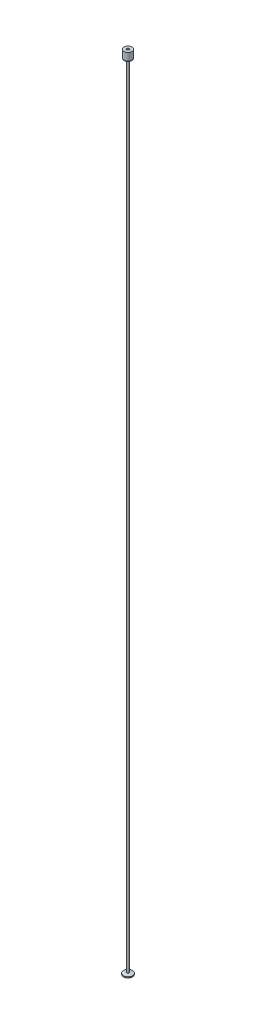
ISO-10303-21;
HEADER;
FILE_DESCRIPTION(('STEP AP214'),'2;1');
FILE_NAME('part.step','',(''),(''),'','','');
FILE_SCHEMA(('AUTOMOTIVE_DESIGN { 1 0 10303 214 1 1 1 1 }'));
ENDSEC;
DATA;
#1=APPLICATION_CONTEXT('core data for automotive mechanical design processes');
#2=APPLICATION_PROTOCOL_DEFINITION('international standard','automotive_design',2000,#1);
#3=PRODUCT_CONTEXT('',#1,'mechanical');
#4=PRODUCT('Part','Part','',(#3));
#5=PRODUCT_RELATED_PRODUCT_CATEGORY('part','',(#4));
#6=PRODUCT_DEFINITION_FORMATION('','',#4);
#7=PRODUCT_DEFINITION_CONTEXT('part definition',#1,'design');
#8=PRODUCT_DEFINITION('design','',#6,#7);
#9=PRODUCT_DEFINITION_SHAPE('','',#8);
#10=(LENGTH_UNIT() NAMED_UNIT(*) SI_UNIT(.MILLI.,.METRE.));
#11=(NAMED_UNIT(*) PLANE_ANGLE_UNIT() SI_UNIT($,.RADIAN.));
#12=(NAMED_UNIT(*) SI_UNIT($,.STERADIAN.) SOLID_ANGLE_UNIT());
#13=UNCERTAINTY_MEASURE_WITH_UNIT(LENGTH_MEASURE(1.E-05),#10,'distance_accuracy_value','');
#14=(GEOMETRIC_REPRESENTATION_CONTEXT(3) GLOBAL_UNCERTAINTY_ASSIGNED_CONTEXT((#13)) GLOBAL_UNIT_ASSIGNED_CONTEXT((#10,
#11,#12)) REPRESENTATION_CONTEXT('',''));
#15=CARTESIAN_POINT('',(0.,0.,0.));
#16=DIRECTION('',(0.,0.,1.));
#17=DIRECTION('',(1.,0.,0.));
#18=AXIS2_PLACEMENT_3D('',#15,#16,#17);
#19=CARTESIAN_POINT('',(0.,1214.5,0.));
#20=DIRECTION('',(0.,1.,0.));
#21=DIRECTION('',(0.,0.,1.));
#22=AXIS2_PLACEMENT_3D('',#19,#20,#21);
#23=PLANE('',#22);
#24=CARTESIAN_POINT('',(0.,1214.5,0.));
#25=DIRECTION('',(0.,1.,0.));
#26=DIRECTION('',(0.,0.,1.));
#27=AXIS2_PLACEMENT_3D('',#24,#25,#26);
#28=CIRCLE('',#27,6.);
#29=CARTESIAN_POINT('',(0.,1214.5,-6.));
#30=VERTEX_POINT('',#29);
#31=EDGE_CURVE('E56',#30,#30,#28,.T.);
#32=ORIENTED_EDGE('',*,*,#31,.T.);
#33=EDGE_LOOP('',(#32));
#34=FACE_BOUND('',#33,.T.);
#35=CARTESIAN_POINT('',(0.,1214.5,0.));
#36=DIRECTION('',(0.,1.,0.));
#37=DIRECTION('',(0.,0.,1.));
#38=AXIS2_PLACEMENT_3D('',#35,#36,#37);
#39=CIRCLE('',#38,1.8999999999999);
#40=CARTESIAN_POINT('',(0.,1214.5,-1.8999999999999));
#41=VERTEX_POINT('',#40);
#42=EDGE_CURVE('E60',#41,#41,#39,.T.);
#43=ORIENTED_EDGE('',*,*,#42,.F.);
#44=EDGE_LOOP('',(#43));
#45=FACE_BOUND('',#44,.T.);
#46=ADVANCED_FACE('F45',(#34,#45),#23,.T.);
#47=CARTESIAN_POINT('',(0.,1201.5,0.));
#48=DIRECTION('',(0.,1.,0.));
#49=DIRECTION('',(0.,0.,1.));
#50=AXIS2_PLACEMENT_3D('',#47,#48,#49);
#51=PLANE('',#50);
#52=CARTESIAN_POINT('',(0.,1201.5,0.));
#53=DIRECTION('',(0.,1.,0.));
#54=DIRECTION('',(0.,0.,1.));
#55=AXIS2_PLACEMENT_3D('',#52,#53,#54);
#56=CIRCLE('',#55,4.);
#57=CARTESIAN_POINT('',(0.,1201.5,4.));
#58=VERTEX_POINT('',#57);
#59=EDGE_CURVE('E11',#58,#58,#56,.F.);
#60=ORIENTED_EDGE('',*,*,#59,.T.);
#61=EDGE_LOOP('',(#60));
#62=FACE_BOUND('',#61,.T.);
#63=CARTESIAN_POINT('',(0.,1201.5,0.));
#64=DIRECTION('',(0.,1.,0.));
#65=DIRECTION('',(0.,0.,1.));
#66=AXIS2_PLACEMENT_3D('',#63,#64,#65);
#67=CIRCLE('',#66,1.8999999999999);
#68=CARTESIAN_POINT('',(0.,1201.5,-1.8999999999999));
#69=VERTEX_POINT('',#68);
#70=EDGE_CURVE('E63',#69,#69,#67,.T.);
#71=ORIENTED_EDGE('',*,*,#70,.T.);
#72=EDGE_LOOP('',(#71));
#73=FACE_BOUND('',#72,.T.);
#74=ADVANCED_FACE('F73',(#62,#73),#51,.F.);
#75=CARTESIAN_POINT('',(0.,1214.5,0.));
#76=DIRECTION('',(0.,-1.,0.));
#77=DIRECTION('',(0.,0.,-1.));
#78=AXIS2_PLACEMENT_3D('',#75,#76,#77);
#79=CYLINDRICAL_SURFACE('',#78,6.);
#80=CARTESIAN_POINT('',(0.,1203.5,0.));
#81=DIRECTION('',(0.,1.,0.));
#82=DIRECTION('',(0.,0.,1.));
#83=AXIS2_PLACEMENT_3D('',#80,#81,#82);
#84=CIRCLE('',#83,6.);
#85=CARTESIAN_POINT('',(0.,1203.5,-6.));
#86=VERTEX_POINT('',#85);
#87=EDGE_CURVE('E52',#86,#86,#84,.T.);
#88=CARTESIAN_POINT('',(0.,1203.5,-6.));
#89=CARTESIAN_POINT('',(0.,1203.61458333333,-6.));
#90=CARTESIAN_POINT('',(0.,1203.72916666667,-6.));
#91=CARTESIAN_POINT('',(0.,1203.95833333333,-6.));
#92=CARTESIAN_POINT('',(0.,1204.07291666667,-6.));
#93=CARTESIAN_POINT('',(0.,1204.30208333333,-6.));
#94=CARTESIAN_POINT('',(0.,1204.41666666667,-6.));
#95=CARTESIAN_POINT('',(0.,1204.64583333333,-6.));
#96=CARTESIAN_POINT('',(0.,1204.76041666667,-6.));
#97=CARTESIAN_POINT('',(0.,1204.98958333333,-6.));
#98=CARTESIAN_POINT('',(0.,1205.10416666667,-6.));
#99=CARTESIAN_POINT('',(0.,1205.33333333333,-6.));
#100=CARTESIAN_POINT('',(0.,1205.44791666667,-6.));
#101=CARTESIAN_POINT('',(0.,1205.67708333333,-6.));
#102=CARTESIAN_POINT('',(0.,1205.79166666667,-6.));
#103=CARTESIAN_POINT('',(0.,1206.02083333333,-6.));
#104=CARTESIAN_POINT('',(0.,1206.13541666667,-6.));
#105=CARTESIAN_POINT('',(0.,1206.36458333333,-6.));
#106=CARTESIAN_POINT('',(0.,1206.47916666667,-6.));
#107=CARTESIAN_POINT('',(0.,1206.70833333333,-6.));
#108=CARTESIAN_POINT('',(0.,1206.82291666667,-6.));
#109=CARTESIAN_POINT('',(0.,1207.05208333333,-6.));
#110=CARTESIAN_POINT('',(0.,1207.16666666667,-6.));
#111=CARTESIAN_POINT('',(0.,1207.39583333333,-6.));
#112=CARTESIAN_POINT('',(0.,1207.51041666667,-6.));
#113=CARTESIAN_POINT('',(0.,1207.73958333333,-6.));
#114=CARTESIAN_POINT('',(0.,1207.85416666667,-6.));
#115=CARTESIAN_POINT('',(0.,1208.08333333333,-6.));
#116=CARTESIAN_POINT('',(0.,1208.19791666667,-6.));
#117=CARTESIAN_POINT('',(0.,1208.42708333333,-6.));
#118=CARTESIAN_POINT('',(0.,1208.54166666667,-6.));
#119=CARTESIAN_POINT('',(0.,1208.77083333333,-6.));
#120=CARTESIAN_POINT('',(0.,1208.88541666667,-6.));
#121=CARTESIAN_POINT('',(0.,1209.11458333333,-6.));
#122=CARTESIAN_POINT('',(0.,1209.22916666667,-6.));
#123=CARTESIAN_POINT('',(0.,1209.45833333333,-6.));
#124=CARTESIAN_POINT('',(0.,1209.57291666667,-6.));
#125=CARTESIAN_POINT('',(0.,1209.80208333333,-6.));
#126=CARTESIAN_POINT('',(0.,1209.91666666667,-6.));
#127=CARTESIAN_POINT('',(0.,1210.14583333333,-6.));
#128=CARTESIAN_POINT('',(0.,1210.26041666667,-6.));
#129=CARTESIAN_POINT('',(0.,1210.48958333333,-6.));
#130=CARTESIAN_POINT('',(0.,1210.60416666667,-6.));
#131=CARTESIAN_POINT('',(0.,1210.83333333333,-6.));
#132=CARTESIAN_POINT('',(0.,1210.94791666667,-6.));
#133=CARTESIAN_POINT('',(0.,1211.17708333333,-6.));
#134=CARTESIAN_POINT('',(0.,1211.29166666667,-6.));
#135=CARTESIAN_POINT('',(0.,1211.52083333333,-6.));
#136=CARTESIAN_POINT('',(0.,1211.63541666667,-6.));
#137=CARTESIAN_POINT('',(0.,1211.86458333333,-6.));
#138=CARTESIAN_POINT('',(0.,1211.97916666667,-6.));
#139=CARTESIAN_POINT('',(0.,1212.20833333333,-6.));
#140=CARTESIAN_POINT('',(0.,1212.32291666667,-6.));
#141=CARTESIAN_POINT('',(0.,1212.55208333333,-6.));
#142=CARTESIAN_POINT('',(0.,1212.66666666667,-6.));
#143=CARTESIAN_POINT('',(0.,1212.89583333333,-6.));
#144=CARTESIAN_POINT('',(0.,1213.01041666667,-6.));
#145=CARTESIAN_POINT('',(0.,1213.23958333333,-6.));
#146=CARTESIAN_POINT('',(0.,1213.35416666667,-6.));
#147=CARTESIAN_POINT('',(0.,1213.58333333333,-6.));
#148=CARTESIAN_POINT('',(0.,1213.69791666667,-6.));
#149=CARTESIAN_POINT('',(0.,1213.92708333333,-6.));
#150=CARTESIAN_POINT('',(0.,1214.04166666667,-6.));
#151=CARTESIAN_POINT('',(0.,1214.27083333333,-6.));
#152=CARTESIAN_POINT('',(0.,1214.38541666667,-6.));
#153=CARTESIAN_POINT('',(0.,1214.5,-6.));
#154=B_SPLINE_CURVE_WITH_KNOTS('',3,(#88,#89,#90,#91,#92,#93,#94,#95,#96,#97,#98,#99,#100,#101,
#102,#103,#104,#105,#106,#107,#108,#109,#110,#111,#112,#113,#114,#115,#116,#117,#118,#119,#120,
#121,#122,#123,#124,#125,#126,#127,#128,#129,#130,#131,#132,#133,#134,#135,#136,#137,#138,#139,
#140,#141,#142,#143,#144,#145,#146,#147,#148,#149,#150,#151,#152,#153),.UNSPECIFIED.,.F.,.F.,(4,
2,2,2,2,2,2,2,2,2,2,2,2,2,2,2,2,2,2,2,2,2,2,2,2,2,2,2,2,2,2,2,4),(0.,0.343750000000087,
0.687500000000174,1.03125000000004,1.37500000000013,1.71874999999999,2.06250000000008,
2.40625000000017,2.75000000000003,3.09375000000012,3.43749999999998,3.78125000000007,
4.12500000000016,4.46875000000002,4.81250000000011,5.15624999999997,5.50000000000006,
5.84375000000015,6.18750000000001,6.5312500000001,6.87499999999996,7.21875000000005,
7.56250000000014,7.90625,8.25000000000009,8.59374999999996,8.93750000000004,9.28125000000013,
9.62499999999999,9.96875000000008,10.3124999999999,10.65625,11.0000000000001),.UNSPECIFIED.);
#155=EDGE_CURVE('BSEAM79',#86,#30,#154,.T.);
#156=ORIENTED_EDGE('',*,*,#87,.T.);
#157=ORIENTED_EDGE('',*,*,#31,.F.);
#158=ORIENTED_EDGE('',*,*,#155,.T.);
#159=ORIENTED_EDGE('',*,*,#155,.F.);
#160=EDGE_LOOP('',(#156,#158,#157,#159));
#161=FACE_BOUND('',#160,.T.);
#162=ADVANCED_FACE('F79',(#161),#79,.T.);
#163=CARTESIAN_POINT('',(0.,1214.5,0.));
#164=DIRECTION('',(0.,-1.,0.));
#165=DIRECTION('',(0.,0.,-1.));
#166=AXIS2_PLACEMENT_3D('',#163,#164,#165);
#167=CYLINDRICAL_SURFACE('',#166,1.8999999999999);
#168=CARTESIAN_POINT('',(0.,1214.5,-1.8999999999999));
#169=CARTESIAN_POINT('',(0.,1214.36458333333,-1.8999999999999));
#170=CARTESIAN_POINT('',(0.,1214.22916666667,-1.8999999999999));
#171=CARTESIAN_POINT('',(0.,1213.95833333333,-1.8999999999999));
#172=CARTESIAN_POINT('',(0.,1213.82291666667,-1.8999999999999));
#173=CARTESIAN_POINT('',(0.,1213.55208333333,-1.8999999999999));
#174=CARTESIAN_POINT('',(0.,1213.41666666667,-1.8999999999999));
#175=CARTESIAN_POINT('',(0.,1213.14583333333,-1.8999999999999));
#176=CARTESIAN_POINT('',(0.,1213.01041666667,-1.8999999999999));
#177=CARTESIAN_POINT('',(0.,1212.73958333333,-1.8999999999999));
#178=CARTESIAN_POINT('',(0.,1212.60416666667,-1.8999999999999));
#179=CARTESIAN_POINT('',(0.,1212.33333333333,-1.8999999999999));
#180=CARTESIAN_POINT('',(0.,1212.19791666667,-1.8999999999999));
#181=CARTESIAN_POINT('',(0.,1211.92708333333,-1.8999999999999));
#182=CARTESIAN_POINT('',(0.,1211.79166666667,-1.8999999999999));
#183=CARTESIAN_POINT('',(0.,1211.52083333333,-1.8999999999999));
#184=CARTESIAN_POINT('',(0.,1211.38541666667,-1.8999999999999));
#185=CARTESIAN_POINT('',(0.,1211.11458333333,-1.8999999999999));
#186=CARTESIAN_POINT('',(0.,1210.97916666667,-1.8999999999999));
#187=CARTESIAN_POINT('',(0.,1210.70833333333,-1.8999999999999));
#188=CARTESIAN_POINT('',(0.,1210.57291666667,-1.8999999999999));
#189=CARTESIAN_POINT('',(0.,1210.30208333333,-1.8999999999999));
#190=CARTESIAN_POINT('',(0.,1210.16666666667,-1.8999999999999));
#191=CARTESIAN_POINT('',(0.,1209.89583333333,-1.8999999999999));
#192=CARTESIAN_POINT('',(0.,1209.76041666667,-1.8999999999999));
#193=CARTESIAN_POINT('',(0.,1209.48958333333,-1.8999999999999));
#194=CARTESIAN_POINT('',(0.,1209.35416666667,-1.8999999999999));
#195=CARTESIAN_POINT('',(0.,1209.08333333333,-1.8999999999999));
#196=CARTESIAN_POINT('',(0.,1208.94791666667,-1.8999999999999));
#197=CARTESIAN_POINT('',(0.,1208.67708333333,-1.8999999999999));
#198=CARTESIAN_POINT('',(0.,1208.54166666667,-1.8999999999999));
#199=CARTESIAN_POINT('',(0.,1208.27083333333,-1.8999999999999));
#200=CARTESIAN_POINT('',(0.,1208.13541666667,-1.8999999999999));
#201=CARTESIAN_POINT('',(0.,1207.86458333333,-1.8999999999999));
#202=CARTESIAN_POINT('',(0.,1207.72916666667,-1.8999999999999));
#203=CARTESIAN_POINT('',(0.,1207.45833333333,-1.8999999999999));
#204=CARTESIAN_POINT('',(0.,1207.32291666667,-1.8999999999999));
#205=CARTESIAN_POINT('',(0.,1207.05208333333,-1.8999999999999));
#206=CARTESIAN_POINT('',(0.,1206.91666666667,-1.8999999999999));
#207=CARTESIAN_POINT('',(0.,1206.64583333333,-1.8999999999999));
#208=CARTESIAN_POINT('',(0.,1206.51041666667,-1.8999999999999));
#209=CARTESIAN_POINT('',(0.,1206.23958333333,-1.8999999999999));
#210=CARTESIAN_POINT('',(0.,1206.10416666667,-1.8999999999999));
#211=CARTESIAN_POINT('',(0.,1205.83333333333,-1.8999999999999));
#212=CARTESIAN_POINT('',(0.,1205.69791666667,-1.8999999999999));
#213=CARTESIAN_POINT('',(0.,1205.42708333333,-1.8999999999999));
#214=CARTESIAN_POINT('',(0.,1205.29166666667,-1.8999999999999));
#215=CARTESIAN_POINT('',(0.,1205.02083333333,-1.8999999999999));
#216=CARTESIAN_POINT('',(0.,1204.88541666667,-1.8999999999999));
#217=CARTESIAN_POINT('',(0.,1204.61458333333,-1.8999999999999));
#218=CARTESIAN_POINT('',(0.,1204.47916666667,-1.8999999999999));
#219=CARTESIAN_POINT('',(0.,1204.20833333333,-1.8999999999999));
#220=CARTESIAN_POINT('',(0.,1204.07291666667,-1.8999999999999));
#221=CARTESIAN_POINT('',(0.,1203.80208333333,-1.8999999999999));
#222=CARTESIAN_POINT('',(0.,1203.66666666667,-1.8999999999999));
#223=CARTESIAN_POINT('',(0.,1203.39583333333,-1.8999999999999));
#224=CARTESIAN_POINT('',(0.,1203.26041666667,-1.8999999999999));
#225=CARTESIAN_POINT('',(0.,1202.98958333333,-1.8999999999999));
#226=CARTESIAN_POINT('',(0.,1202.85416666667,-1.8999999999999));
#227=CARTESIAN_POINT('',(0.,1202.58333333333,-1.8999999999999));
#228=CARTESIAN_POINT('',(0.,1202.44791666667,-1.8999999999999));
#229=CARTESIAN_POINT('',(0.,1202.17708333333,-1.8999999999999));
#230=CARTESIAN_POINT('',(0.,1202.04166666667,-1.8999999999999));
#231=CARTESIAN_POINT('',(0.,1201.77083333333,-1.8999999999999));
#232=CARTESIAN_POINT('',(0.,1201.63541666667,-1.8999999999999));
#233=CARTESIAN_POINT('',(0.,1201.5,-1.8999999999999));
#234=B_SPLINE_CURVE_WITH_KNOTS('',3,(#168,#169,#170,#171,#172,#173,#174,#175,#176,#177,#178,
#179,#180,#181,#182,#183,#184,#185,#186,#187,#188,#189,#190,#191,#192,#193,#194,#195,#196,#197,
#198,#199,#200,#201,#202,#203,#204,#205,#206,#207,#208,#209,#210,#211,#212,#213,#214,#215,#216,
#217,#218,#219,#220,#221,#222,#223,#224,#225,#226,#227,#228,#229,#230,#231,#232,#233),
.UNSPECIFIED.,.F.,.F.,(4,2,2,2,2,2,2,2,2,2,2,2,2,2,2,2,2,2,2,2,2,2,2,2,2,2,2,2,2,2,2,2,4),(0.,
0.406250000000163,0.812500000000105,1.21875000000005,1.62499999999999,2.03125000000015,
2.43750000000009,2.84375000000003,3.24999999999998,3.65625000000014,4.06250000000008,
4.46875000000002,4.87499999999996,5.28125000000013,5.68750000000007,6.09375000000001,
6.49999999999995,6.90625000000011,7.31250000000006,7.71875,8.12499999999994,8.5312500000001,
8.93750000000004,9.34374999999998,9.74999999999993,10.1562500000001,10.5625,10.96875,
11.3749999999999,11.7812500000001,12.1875,12.59375,12.9999999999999),.UNSPECIFIED.);
#235=EDGE_CURVE('BSEAM69',#41,#69,#234,.T.);
#236=ORIENTED_EDGE('',*,*,#42,.T.);
#237=ORIENTED_EDGE('',*,*,#70,.F.);
#238=ORIENTED_EDGE('',*,*,#235,.T.);
#239=ORIENTED_EDGE('',*,*,#235,.F.);
#240=EDGE_LOOP('',(#236,#238,#237,#239));
#241=FACE_BOUND('',#240,.T.);
#242=ADVANCED_FACE('F69',(#241),#167,.F.);
#243=CARTESIAN_POINT('',(0.,1203.5,0.));
#244=DIRECTION('',(0.,1.,0.));
#245=DIRECTION('',(0.,0.,1.));
#246=AXIS2_PLACEMENT_3D('',#243,#244,#245);
#247=TOROIDAL_SURFACE('',#246,4.,2.);
#248=ORIENTED_EDGE('',*,*,#59,.F.);
#249=EDGE_LOOP('',(#248));
#250=FACE_BOUND('',#249,.T.);
#251=ORIENTED_EDGE('',*,*,#87,.F.);
#252=EDGE_LOOP('',(#251));
#253=FACE_BOUND('',#252,.T.);
#254=ADVANCED_FACE('F47',(#250,#253),#247,.T.);
#255=CLOSED_SHELL('',(#46,#74,#162,#242,#254));
#256=MANIFOLD_SOLID_BREP('B2',#255);
#257=CARTESIAN_POINT('',(0.,2.5,0.));
#258=DIRECTION('',(0.,-1.,0.));
#259=DIRECTION('',(0.,0.,-1.));
#260=AXIS2_PLACEMENT_3D('',#257,#258,#259);
#261=CYLINDRICAL_SURFACE('',#260,6.9);
#262=CARTESIAN_POINT('',(0.,1.61836509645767,0.));
#263=DIRECTION('',(0.,1.,0.));
#264=DIRECTION('',(0.,0.,1.));
#265=AXIS2_PLACEMENT_3D('',#262,#263,#264);
#266=CIRCLE('',#265,6.9);
#267=CARTESIAN_POINT('',(0.,1.61836509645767,-6.9));
#268=VERTEX_POINT('',#267);
#269=EDGE_CURVE('E127',#268,#268,#266,.F.);
#270=ORIENTED_EDGE('',*,*,#269,.T.);
#271=EDGE_LOOP('',(#270));
#272=FACE_BOUND('',#271,.T.);
#273=CARTESIAN_POINT('',(0.,0.,0.));
#274=DIRECTION('',(0.,1.,0.));
#275=DIRECTION('',(0.,0.,1.));
#276=AXIS2_PLACEMENT_3D('',#273,#274,#275);
#277=CIRCLE('',#276,6.9);
#278=CARTESIAN_POINT('',(0.,0.,6.9));
#279=VERTEX_POINT('',#278);
#280=EDGE_CURVE('E139',#279,#279,#277,.T.);
#281=ORIENTED_EDGE('',*,*,#280,.T.);
#282=EDGE_LOOP('',(#281));
#283=FACE_BOUND('',#282,.T.);
#284=ADVANCED_FACE('F122',(#272,#283),#261,.T.);
#285=CARTESIAN_POINT('',(0.,2.5,0.));
#286=DIRECTION('',(0.,1.,0.));
#287=DIRECTION('',(0.,0.,1.));
#288=AXIS2_PLACEMENT_3D('',#285,#286,#287);
#289=PLANE('',#288);
#290=CARTESIAN_POINT('',(0.,2.5,0.));
#291=DIRECTION('',(0.,1.,0.));
#292=DIRECTION('',(0.,0.,1.));
#293=AXIS2_PLACEMENT_3D('',#290,#291,#292);
#294=CIRCLE('',#293,1.5);
#295=CARTESIAN_POINT('',(0.,2.5,1.5));
#296=VERTEX_POINT('',#295);
#297=EDGE_CURVE('E44',#296,#296,#294,.T.);
#298=ORIENTED_EDGE('',*,*,#297,.F.);
#299=EDGE_LOOP('',(#298));
#300=FACE_BOUND('',#299,.T.);
#301=CARTESIAN_POINT('',(0.,2.5,0.));
#302=DIRECTION('',(0.,1.,0.));
#303=DIRECTION('',(0.,0.,1.));
#304=AXIS2_PLACEMENT_3D('',#301,#302,#303);
#305=CIRCLE('',#304,1.8999999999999);
#306=CARTESIAN_POINT('',(0.,2.5,-1.8999999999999));
#307=VERTEX_POINT('',#306);
#308=EDGE_CURVE('E135',#307,#307,#305,.T.);
#309=ORIENTED_EDGE('',*,*,#308,.T.);
#310=EDGE_LOOP('',(#309));
#311=FACE_BOUND('',#310,.T.);
#312=ADVANCED_FACE('F144',(#300,#311),#289,.T.);
#313=CARTESIAN_POINT('',(0.,0.,0.));
#314=DIRECTION('',(0.,1.,0.));
#315=DIRECTION('',(0.,0.,1.));
#316=AXIS2_PLACEMENT_3D('',#313,#314,#315);
#317=PLANE('',#316);
#318=ORIENTED_EDGE('',*,*,#280,.F.);
#319=EDGE_LOOP('',(#318));
#320=FACE_BOUND('',#319,.T.);
#321=ADVANCED_FACE('F148',(#320),#317,.F.);
#322=CARTESIAN_POINT('',(0.,2.5,0.));
#323=DIRECTION('',(0.,-1.,0.));
#324=DIRECTION('',(0.,0.,-1.));
#325=AXIS2_PLACEMENT_3D('',#322,#323,#324);
#326=CONICAL_SURFACE('',#325,1.8999999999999,1.39626340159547);
#327=CARTESIAN_POINT('',(0.,1.61836509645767,-6.9));
#328=CARTESIAN_POINT('',(0.,1.62754879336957,-6.84791666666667));
#329=CARTESIAN_POINT('',(0.,1.63673249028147,-6.79583333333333));
#330=CARTESIAN_POINT('',(0.,1.65509988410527,-6.69166666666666));
#331=CARTESIAN_POINT('',(0.,1.66428358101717,-6.63958333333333));
#332=CARTESIAN_POINT('',(0.,1.68265097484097,-6.53541666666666));
#333=CARTESIAN_POINT('',(0.,1.69183467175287,-6.48333333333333));
#334=CARTESIAN_POINT('',(0.,1.71020206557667,-6.37916666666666));
#335=CARTESIAN_POINT('',(0.,1.71938576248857,-6.32708333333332));
#336=CARTESIAN_POINT('',(0.,1.73775315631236,-6.22291666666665));
#337=CARTESIAN_POINT('',(0.,1.74693685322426,-6.17083333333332));
#338=CARTESIAN_POINT('',(0.,1.76530424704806,-6.06666666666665));
#339=CARTESIAN_POINT('',(0.,1.77448794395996,-6.01458333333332));
#340=CARTESIAN_POINT('',(0.,1.79285533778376,-5.91041666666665));
#341=CARTESIAN_POINT('',(0.,1.80203903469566,-5.85833333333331));
#342=CARTESIAN_POINT('',(0.,1.82040642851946,-5.75416666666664));
#343=CARTESIAN_POINT('',(0.,1.82959012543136,-5.70208333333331));
#344=CARTESIAN_POINT('',(0.,1.84795751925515,-5.59791666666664));
#345=CARTESIAN_POINT('',(0.,1.85714121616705,-5.54583333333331));
#346=CARTESIAN_POINT('',(0.,1.87550860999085,-5.44166666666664));
#347=CARTESIAN_POINT('',(0.,1.88469230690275,-5.3895833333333));
#348=CARTESIAN_POINT('',(0.,1.90305970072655,-5.28541666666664));
#349=CARTESIAN_POINT('',(0.,1.91224339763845,-5.2333333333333));
#350=CARTESIAN_POINT('',(0.,1.93061079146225,-5.12916666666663));
#351=CARTESIAN_POINT('',(0.,1.93979448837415,-5.0770833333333));
#352=CARTESIAN_POINT('',(0.,1.95816188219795,-4.97291666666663));
#353=CARTESIAN_POINT('',(0.,1.96734557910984,-4.9208333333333));
#354=CARTESIAN_POINT('',(0.,1.98571297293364,-4.81666666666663));
#355=CARTESIAN_POINT('',(0.,1.99489666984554,-4.76458333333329));
#356=CARTESIAN_POINT('',(0.,2.01326406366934,-4.66041666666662));
#357=CARTESIAN_POINT('',(0.,2.02244776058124,-4.60833333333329));
#358=CARTESIAN_POINT('',(0.,2.04081515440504,-4.50416666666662));
#359=CARTESIAN_POINT('',(0.,2.04999885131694,-4.45208333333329));
#360=CARTESIAN_POINT('',(0.,2.06836624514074,-4.34791666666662));
#361=CARTESIAN_POINT('',(0.,2.07754994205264,-4.29583333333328));
#362=CARTESIAN_POINT('',(0.,2.09591733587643,-4.19166666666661));
#363=CARTESIAN_POINT('',(0.,2.10510103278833,-4.13958333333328));
#364=CARTESIAN_POINT('',(0.,2.12346842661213,-4.03541666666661));
#365=CARTESIAN_POINT('',(0.,2.13265212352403,-3.98333333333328));
#366=CARTESIAN_POINT('',(0.,2.15101951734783,-3.87916666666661));
#367=CARTESIAN_POINT('',(0.,2.16020321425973,-3.82708333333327));
#368=CARTESIAN_POINT('',(0.,2.17857060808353,-3.72291666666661));
#369=CARTESIAN_POINT('',(0.,2.18775430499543,-3.67083333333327));
#370=CARTESIAN_POINT('',(0.,2.20612169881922,-3.5666666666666));
#371=CARTESIAN_POINT('',(0.,2.21530539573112,-3.51458333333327));
#372=CARTESIAN_POINT('',(0.,2.23367278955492,-3.4104166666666));
#373=CARTESIAN_POINT('',(0.,2.24285648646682,-3.35833333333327));
#374=CARTESIAN_POINT('',(0.,2.26122388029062,-3.2541666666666));
#375=CARTESIAN_POINT('',(0.,2.27040757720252,-3.20208333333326));
#376=CARTESIAN_POINT('',(0.,2.28877497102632,-3.09791666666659));
#377=CARTESIAN_POINT('',(0.,2.29795866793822,-3.04583333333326));
#378=CARTESIAN_POINT('',(0.,2.31632606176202,-2.94166666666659));
#379=CARTESIAN_POINT('',(0.,2.32550975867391,-2.88958333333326));
#380=CARTESIAN_POINT('',(0.,2.34387715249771,-2.78541666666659));
#381=CARTESIAN_POINT('',(0.,2.35306084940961,-2.73333333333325));
#382=CARTESIAN_POINT('',(0.,2.37142824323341,-2.62916666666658));
#383=CARTESIAN_POINT('',(0.,2.38061194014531,-2.57708333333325));
#384=CARTESIAN_POINT('',(0.,2.39897933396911,-2.47291666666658));
#385=CARTESIAN_POINT('',(0.,2.40816303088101,-2.42083333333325));
#386=CARTESIAN_POINT('',(0.,2.42653042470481,-2.31666666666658));
#387=CARTESIAN_POINT('',(0.,2.43571412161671,-2.26458333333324));
#388=CARTESIAN_POINT('',(0.,2.4540815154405,-2.16041666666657));
#389=CARTESIAN_POINT('',(0.,2.4632652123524,-2.10833333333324));
#390=CARTESIAN_POINT('',(0.,2.4816326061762,-2.00416666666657));
#391=CARTESIAN_POINT('',(0.,2.4908163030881,-1.95208333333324));
#392=CARTESIAN_POINT('',(0.,2.5,-1.8999999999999));
#393=B_SPLINE_CURVE_WITH_KNOTS('',3,(#327,#328,#329,#330,#331,#332,#333,#334,#335,#336,#337,
#338,#339,#340,#341,#342,#343,#344,#345,#346,#347,#348,#349,#350,#351,#352,#353,#354,#355,#356,
#357,#358,#359,#360,#361,#362,#363,#364,#365,#366,#367,#368,#369,#370,#371,#372,#373,#374,#375,
#376,#377,#378,#379,#380,#381,#382,#383,#384,#385,#386,#387,#388,#389,#390,#391,#392),
.UNSPECIFIED.,.F.,.F.,(4,2,2,2,2,2,2,2,2,2,2,2,2,2,2,2,2,2,2,2,2,2,2,2,2,2,2,2,2,2,2,2,4),(0.,
0.158660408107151,0.317320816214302,0.475981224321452,0.634641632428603,0.793302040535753,
0.951962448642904,1.11062285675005,1.26928326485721,1.42794367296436,1.58660408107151,
1.74526448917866,1.90392489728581,2.06258530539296,2.22124571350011,2.37990612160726,
2.53856652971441,2.69722693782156,2.85588734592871,3.01454775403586,3.17320816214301,
3.33186857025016,3.49052897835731,3.64918938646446,3.80784979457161,3.96651020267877,
4.12517061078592,4.28383101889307,4.44249142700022,4.60115183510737,4.75981224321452,
4.91847265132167,5.07713305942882),.UNSPECIFIED.);
#394=EDGE_CURVE('BSEAM125',#268,#307,#393,.T.);
#395=ORIENTED_EDGE('',*,*,#269,.F.);
#396=ORIENTED_EDGE('',*,*,#308,.F.);
#397=ORIENTED_EDGE('',*,*,#394,.T.);
#398=ORIENTED_EDGE('',*,*,#394,.F.);
#399=EDGE_LOOP('',(#395,#397,#396,#398));
#400=FACE_BOUND('',#399,.T.);
#401=ADVANCED_FACE('F125',(#400),#326,.T.);
#402=CARTESIAN_POINT('',(0.,1202.5,0.));
#403=DIRECTION('',(0.,-1.,0.));
#404=DIRECTION('',(0.,0.,-1.));
#405=AXIS2_PLACEMENT_3D('',#402,#403,#404);
#406=CYLINDRICAL_SURFACE('',#405,1.5);
#407=CARTESIAN_POINT('',(0.,1202.5,0.));
#408=DIRECTION('',(0.,1.,0.));
#409=DIRECTION('',(0.,0.,1.));
#410=AXIS2_PLACEMENT_3D('',#407,#408,#409);
#411=CIRCLE('',#410,1.5);
#412=CARTESIAN_POINT('',(0.,1202.5,1.5));
#413=VERTEX_POINT('',#412);
#414=EDGE_CURVE('E138',#413,#413,#411,.T.);
#415=ORIENTED_EDGE('',*,*,#414,.F.);
#416=EDGE_LOOP('',(#415));
#417=FACE_BOUND('',#416,.T.);
#418=ORIENTED_EDGE('',*,*,#297,.T.);
#419=EDGE_LOOP('',(#418));
#420=FACE_BOUND('',#419,.T.);
#421=ADVANCED_FACE('F147',(#417,#420),#406,.T.);
#422=CARTESIAN_POINT('',(0.,1202.5,0.));
#423=DIRECTION('',(0.,1.,0.));
#424=DIRECTION('',(0.,0.,1.));
#425=AXIS2_PLACEMENT_3D('',#422,#423,#424);
#426=PLANE('',#425);
#427=ORIENTED_EDGE('',*,*,#414,.T.);
#428=EDGE_LOOP('',(#427));
#429=FACE_BOUND('',#428,.T.);
#430=ADVANCED_FACE('F154',(#429),#426,.T.);
#431=CLOSED_SHELL('',(#284,#312,#321,#401,#421,#430));
#432=MANIFOLD_SOLID_BREP('B6',#431);
#433=ADVANCED_BREP_SHAPE_REPRESENTATION('',(#18,#256,#432),#14);
#434=SHAPE_DEFINITION_REPRESENTATION(#9,#433);
ENDSEC;
END-ISO-10303-21;
